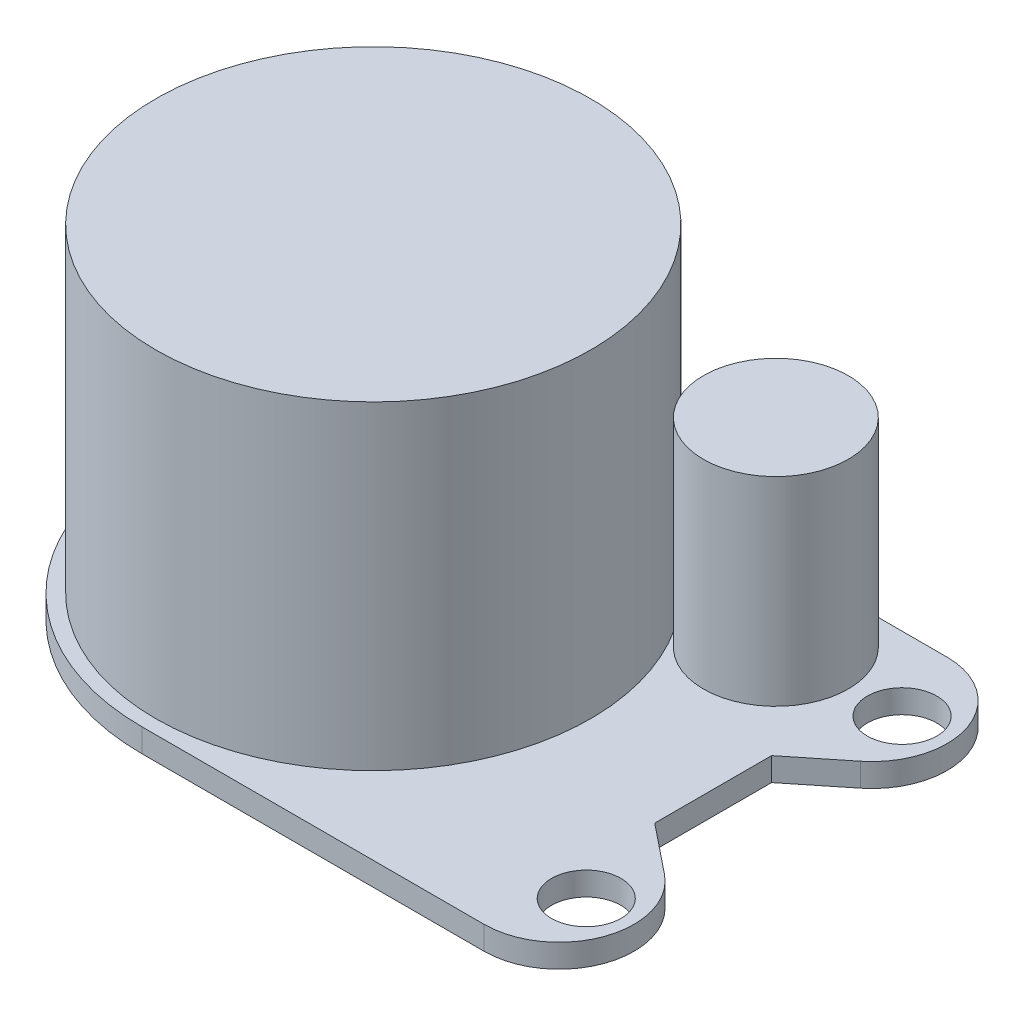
from build123d import *

# Parameters (mm, degrees)
BOSS_EXTRUDE1_DEPTH = 1
SKETCH2_R           = 9.305
BOSS_EXTRUDE2_DEPTH = 13.66
SKETCH3_R           = 3.1
BOSS_EXTRUDE3_DEPTH = 8.51
SKETCH4_R           = 1.485
CUT_EXTRUDE1_DEPTH  = 8.51


with BuildPart() as part:
    # Sketch1 → Boss-Extrude1 (new body)
    with BuildSketch(Plane(origin=(0, 0, 0), x_dir=(1, 0, 0), z_dir=(0, 1, 0))):
        with BuildLine():
            Line((-13.933041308, 13.509742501), (-28.57709975, 13.509742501))
            ThreePointArc((-28.57709975, 13.509742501), (-38.47709975, 3.609742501), (-28.57709975, -6.290257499))
            Line((-28.57709975, -6.290257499), (-13.933041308, -6.290257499))
            ThreePointArc((-13.933041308, -6.290257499), (-10.908622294, -4.147777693), (-11.926545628, -0.583908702))
            Line((-11.926545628, -0.583908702), (-14.03709975, 1.109742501))
            Line((-14.03709975, 1.109742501), (-14.03709975, 6.109742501))
            Line((-14.03709975, 6.109742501), (-11.926545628, 7.803393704))
            ThreePointArc((-11.926545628, 7.803393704), (-10.908622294, 11.367262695), (-13.933041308, 13.509742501))
        make_face()
    extrude(amount=BOSS_EXTRUDE1_DEPTH)

    # Sketch2 → Boss-Extrude2 (add)
    with BuildSketch(Plane(origin=(0, 1, 0), x_dir=(1, 0, 0), z_dir=(0, 1, 0))):
        with Locations(Location((-28.57709975, 3.609742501, 0), (0, 0, 270))):
            Circle(SKETCH2_R)
    extrude(amount=BOSS_EXTRUDE2_DEPTH)

    # Sketch3 → Boss-Extrude3 (add)
    with BuildSketch(Plane(origin=(0, 1, 0), x_dir=(1, 0, 0), z_dir=(0, 1, 0))):
        with Locations(Location((-17.962659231, 10.215706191, 0), (0, 0, 270))):
            Circle(SKETCH3_R)
    extrude(amount=BOSS_EXTRUDE3_DEPTH)

    # Sketch4 → Cut-Extrude1 (cut)
    with BuildSketch(Plane(origin=(0, 1, 0), x_dir=(1, 0, 0), z_dir=(0, 1, 0))):
        with Locations(Location((-12.71209975, 10.364742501, 0), (0, 0, 270))):
            Circle(SKETCH4_R)
        with Locations(Location((-12.71209975, -3.145257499, 0), (0, 0, 270))):
            Circle(SKETCH4_R)
    extrude(amount=-CUT_EXTRUDE1_DEPTH, mode=Mode.SUBTRACT)


solid = part.part
